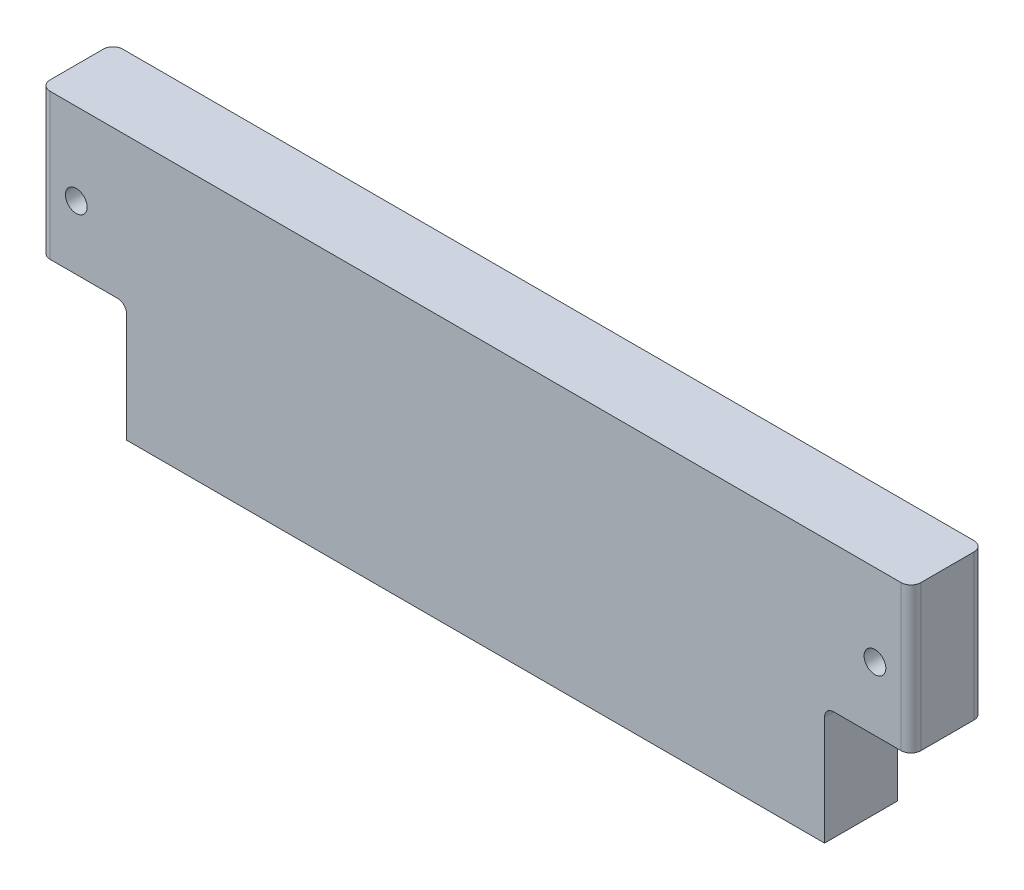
from build123d import *

# Parameters (mm, degrees)
SKETCH1_W              = 151.892
SKETCH1_H              = 25.4
BOSS_EXTRUDE1_DEPTH    = 6.35
F_10_24_TAPPED_HOLE1_D = 3.7973
SKETCH6_W              = 121.7422
SKETCH6_H              = 20.6375
BOSS_EXTRUDE2_DEPTH    = 12.7
FILLET1_R              = 1.7145
FILLET2_R              = 1.5875


with BuildPart() as part:
    # Sketch1 → Boss-Extrude1 (new, symmetric)
    with BuildSketch(Plane.XY):
        Rectangle(SKETCH1_W, SKETCH1_H)
    extrude(amount=BOSS_EXTRUDE1_DEPTH, both=True)

    # 10-24 Tapped Hole1 (through all)
    with Locations(Plane.XY.offset(6.35)):
        with Locations((-69.6595, -1.5875), (69.6595, -1.5875)):
            Hole(F_10_24_TAPPED_HOLE1_D / 2)

    # Sketch6 → Boss-Extrude2 (add)
    with BuildSketch(Plane.XY.offset(6.35)):
        with Locations((0, -23.01875)):
            Rectangle(SKETCH6_W, SKETCH6_H)
    extrude(amount=-BOSS_EXTRUDE2_DEPTH)

    # Fillet1
    fillet1_edges = [part.edges().sort_by_distance(p)[0] for p in [
        (-75.946, 0, 6.35),
        (75.946, 0, 6.35),
        (-75.946, 0, -6.35),
        (75.946, 0, -6.35),
    ]]
    fillet(fillet1_edges, radius=FILLET1_R)

    # Fillet2
    fillet2_edges = [part.edges().sort_by_distance(p)[0] for p in [
        (-60.8711, -12.7, 0),
        (60.8711, -12.7, 0),
    ]]
    fillet(fillet2_edges, radius=FILLET2_R)


solid = part.part
